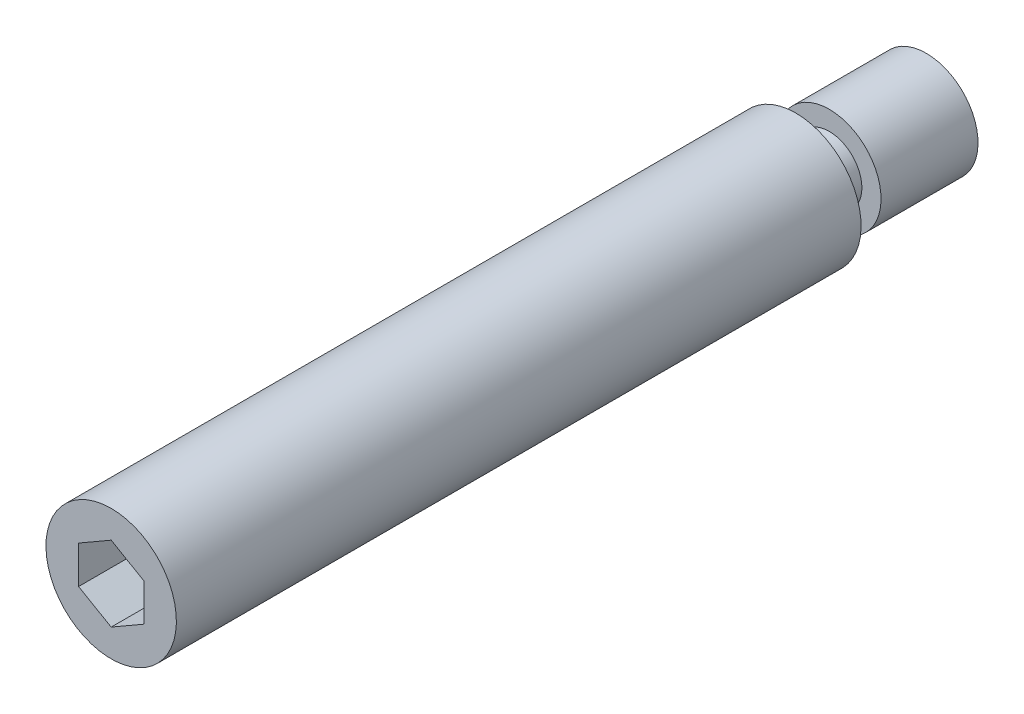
ISO-10303-21;
HEADER;
FILE_DESCRIPTION(('STEP AP214'),'2;1');
FILE_NAME('part.step','',(''),(''),'','','');
FILE_SCHEMA(('AUTOMOTIVE_DESIGN { 1 0 10303 214 1 1 1 1 }'));
ENDSEC;
DATA;
#1=APPLICATION_CONTEXT('core data for automotive mechanical design processes');
#2=APPLICATION_PROTOCOL_DEFINITION('international standard','automotive_design',2000,#1);
#3=PRODUCT_CONTEXT('',#1,'mechanical');
#4=PRODUCT('Part','Part','',(#3));
#5=PRODUCT_RELATED_PRODUCT_CATEGORY('part','',(#4));
#6=PRODUCT_DEFINITION_FORMATION('','',#4);
#7=PRODUCT_DEFINITION_CONTEXT('part definition',#1,'design');
#8=PRODUCT_DEFINITION('design','',#6,#7);
#9=PRODUCT_DEFINITION_SHAPE('','',#8);
#10=(LENGTH_UNIT() NAMED_UNIT(*) SI_UNIT(.MILLI.,.METRE.));
#11=(NAMED_UNIT(*) PLANE_ANGLE_UNIT() SI_UNIT($,.RADIAN.));
#12=(NAMED_UNIT(*) SI_UNIT($,.STERADIAN.) SOLID_ANGLE_UNIT());
#13=UNCERTAINTY_MEASURE_WITH_UNIT(LENGTH_MEASURE(1.E-05),#10,'distance_accuracy_value','');
#14=(GEOMETRIC_REPRESENTATION_CONTEXT(3) GLOBAL_UNCERTAINTY_ASSIGNED_CONTEXT((#13)) GLOBAL_UNIT_ASSIGNED_CONTEXT((#10,
#11,#12)) REPRESENTATION_CONTEXT('',''));
#15=CARTESIAN_POINT('',(0.,0.,0.));
#16=DIRECTION('',(0.,0.,1.));
#17=DIRECTION('',(1.,0.,0.));
#18=AXIS2_PLACEMENT_3D('',#15,#16,#17);
#19=CARTESIAN_POINT('',(0.,-8.,16.));
#20=DIRECTION('',(0.,0.,-1.));
#21=DIRECTION('',(0.,-1.,0.));
#22=AXIS2_PLACEMENT_3D('',#19,#20,#21);
#23=PLANE('',#22);
#24=CARTESIAN_POINT('',(0.,0.,16.));
#25=DIRECTION('',(0.,0.,1.));
#26=DIRECTION('',(0.,1.,0.));
#27=AXIS2_PLACEMENT_3D('',#24,#25,#26);
#28=CIRCLE('',#27,4.);
#29=CARTESIAN_POINT('',(0.,4.,16.));
#30=VERTEX_POINT('',#29);
#31=EDGE_CURVE('E115',#30,#30,#28,.T.);
#32=ORIENTED_EDGE('',*,*,#31,.T.);
#33=EDGE_LOOP('',(#32));
#34=FACE_BOUND('',#33,.T.);
#35=CARTESIAN_POINT('',(0.,0.,16.));
#36=DIRECTION('',(0.,0.,1.));
#37=DIRECTION('',(0.,1.,0.));
#38=AXIS2_PLACEMENT_3D('',#35,#36,#37);
#39=CIRCLE('',#38,8.);
#40=CARTESIAN_POINT('',(0.,8.,16.));
#41=VERTEX_POINT('',#40);
#42=EDGE_CURVE('E9',#41,#41,#39,.T.);
#43=ORIENTED_EDGE('',*,*,#42,.F.);
#44=EDGE_LOOP('',(#43));
#45=FACE_BOUND('',#44,.T.);
#46=ADVANCED_FACE('F14',(#34,#45),#23,.T.);
#47=CARTESIAN_POINT('',(0.,0.,20.));
#48=DIRECTION('',(0.,0.,1.));
#49=DIRECTION('',(0.,1.,0.));
#50=AXIS2_PLACEMENT_3D('',#47,#48,#49);
#51=CYLINDRICAL_SURFACE('',#50,8.);
#52=CARTESIAN_POINT('',(0.,0.,100.));
#53=DIRECTION('',(0.,0.,1.));
#54=DIRECTION('',(0.,1.,0.));
#55=AXIS2_PLACEMENT_3D('',#52,#53,#54);
#56=CIRCLE('',#55,8.);
#57=CARTESIAN_POINT('',(0.,8.,100.));
#58=VERTEX_POINT('',#57);
#59=EDGE_CURVE('E21',#58,#58,#56,.T.);
#60=ORIENTED_EDGE('',*,*,#59,.F.);
#61=EDGE_LOOP('',(#60));
#62=FACE_BOUND('',#61,.T.);
#63=ORIENTED_EDGE('',*,*,#42,.T.);
#64=EDGE_LOOP('',(#63));
#65=FACE_BOUND('',#64,.T.);
#66=ADVANCED_FACE('F136',(#62,#65),#51,.T.);
#67=CARTESIAN_POINT('',(0.,-8.,100.));
#68=DIRECTION('',(0.,0.,-1.));
#69=DIRECTION('',(0.,-1.,0.));
#70=AXIS2_PLACEMENT_3D('',#67,#68,#69);
#71=PLANE('',#70);
#72=DIRECTION('',(-0.866025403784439,-0.5,0.));
#73=VECTOR('',#72,1.);
#74=CARTESIAN_POINT('',(0.,4.61880215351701,100.));
#75=LINE('',#74,#73);
#76=CARTESIAN_POINT('',(0.,4.61880215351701,100.));
#77=VERTEX_POINT('',#76);
#78=CARTESIAN_POINT('',(-4.,2.30940107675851,100.));
#79=VERTEX_POINT('',#78);
#80=EDGE_CURVE('E102',#77,#79,#75,.T.);
#81=ORIENTED_EDGE('',*,*,#80,.F.);
#82=DIRECTION('',(-0.866025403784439,0.5,0.));
#83=VECTOR('',#82,1.);
#84=CARTESIAN_POINT('',(4.,2.30940107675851,100.));
#85=LINE('',#84,#83);
#86=CARTESIAN_POINT('',(4.,2.30940107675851,100.));
#87=VERTEX_POINT('',#86);
#88=EDGE_CURVE('E28',#87,#77,#85,.T.);
#89=ORIENTED_EDGE('',*,*,#88,.F.);
#90=DIRECTION('',(0.,1.,0.));
#91=VECTOR('',#90,1.);
#92=CARTESIAN_POINT('',(4.,-2.30940107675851,100.));
#93=LINE('',#92,#91);
#94=CARTESIAN_POINT('',(4.,-2.30940107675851,100.));
#95=VERTEX_POINT('',#94);
#96=EDGE_CURVE('E111',#95,#87,#93,.T.);
#97=ORIENTED_EDGE('',*,*,#96,.F.);
#98=DIRECTION('',(0.866025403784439,0.5,0.));
#99=VECTOR('',#98,1.);
#100=CARTESIAN_POINT('',(0.,-4.61880215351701,100.));
#101=LINE('',#100,#99);
#102=CARTESIAN_POINT('',(0.,-4.61880215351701,100.));
#103=VERTEX_POINT('',#102);
#104=EDGE_CURVE('E109',#103,#95,#101,.T.);
#105=ORIENTED_EDGE('',*,*,#104,.F.);
#106=DIRECTION('',(0.866025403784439,-0.5,0.));
#107=VECTOR('',#106,1.);
#108=CARTESIAN_POINT('',(-4.,-2.30940107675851,100.));
#109=LINE('',#108,#107);
#110=CARTESIAN_POINT('',(-4.,-2.30940107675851,100.));
#111=VERTEX_POINT('',#110);
#112=EDGE_CURVE('E76',#111,#103,#109,.T.);
#113=ORIENTED_EDGE('',*,*,#112,.F.);
#114=DIRECTION('',(0.,-1.,0.));
#115=VECTOR('',#114,1.);
#116=CARTESIAN_POINT('',(-4.,2.30940107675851,100.));
#117=LINE('',#116,#115);
#118=EDGE_CURVE('E105',#79,#111,#117,.T.);
#119=ORIENTED_EDGE('',*,*,#118,.F.);
#120=EDGE_LOOP('',(#81,#89,#97,#105,#113,#119));
#121=FACE_BOUND('',#120,.T.);
#122=ORIENTED_EDGE('',*,*,#59,.T.);
#123=EDGE_LOOP('',(#122));
#124=FACE_BOUND('',#123,.T.);
#125=ADVANCED_FACE('F134',(#121,#124),#71,.F.);
#126=CARTESIAN_POINT('',(0.,-6.35,0.));
#127=DIRECTION('',(0.,0.,-1.));
#128=DIRECTION('',(0.,-1.,0.));
#129=AXIS2_PLACEMENT_3D('',#126,#127,#128);
#130=PLANE('',#129);
#131=CARTESIAN_POINT('',(0.,0.,0.));
#132=DIRECTION('',(0.,0.,1.));
#133=DIRECTION('',(0.,1.,0.));
#134=AXIS2_PLACEMENT_3D('',#131,#132,#133);
#135=CIRCLE('',#134,6.35);
#136=CARTESIAN_POINT('',(0.,6.35,0.));
#137=VERTEX_POINT('',#136);
#138=EDGE_CURVE('E129',#137,#137,#135,.T.);
#139=ORIENTED_EDGE('',*,*,#138,.F.);
#140=EDGE_LOOP('',(#139));
#141=FACE_BOUND('',#140,.T.);
#142=ADVANCED_FACE('F167',(#141),#130,.T.);
#143=CARTESIAN_POINT('',(0.,0.,20.));
#144=DIRECTION('',(0.,0.,1.));
#145=DIRECTION('',(0.,1.,0.));
#146=AXIS2_PLACEMENT_3D('',#143,#144,#145);
#147=CYLINDRICAL_SURFACE('',#146,6.35);
#148=ORIENTED_EDGE('',*,*,#138,.T.);
#149=EDGE_LOOP('',(#148));
#150=FACE_BOUND('',#149,.T.);
#151=CARTESIAN_POINT('',(0.,0.,11.9));
#152=DIRECTION('',(0.,0.,1.));
#153=DIRECTION('',(0.,1.,0.));
#154=AXIS2_PLACEMENT_3D('',#151,#152,#153);
#155=CIRCLE('',#154,6.35);
#156=CARTESIAN_POINT('',(0.,6.35,11.9));
#157=VERTEX_POINT('',#156);
#158=EDGE_CURVE('E126',#157,#157,#155,.T.);
#159=ORIENTED_EDGE('',*,*,#158,.F.);
#160=EDGE_LOOP('',(#159));
#161=FACE_BOUND('',#160,.T.);
#162=ADVANCED_FACE('F160',(#150,#161),#147,.T.);
#163=CARTESIAN_POINT('',(0.,-4.,11.9));
#164=DIRECTION('',(0.,0.,1.));
#165=DIRECTION('',(0.,1.,0.));
#166=AXIS2_PLACEMENT_3D('',#163,#164,#165);
#167=PLANE('',#166);
#168=ORIENTED_EDGE('',*,*,#158,.T.);
#169=EDGE_LOOP('',(#168));
#170=FACE_BOUND('',#169,.T.);
#171=CARTESIAN_POINT('',(0.,0.,11.9));
#172=DIRECTION('',(0.,0.,1.));
#173=DIRECTION('',(0.,1.,0.));
#174=AXIS2_PLACEMENT_3D('',#171,#172,#173);
#175=CIRCLE('',#174,4.);
#176=CARTESIAN_POINT('',(0.,4.,11.9));
#177=VERTEX_POINT('',#176);
#178=EDGE_CURVE('E123',#177,#177,#175,.T.);
#179=ORIENTED_EDGE('',*,*,#178,.F.);
#180=EDGE_LOOP('',(#179));
#181=FACE_BOUND('',#180,.T.);
#182=ADVANCED_FACE('F151',(#170,#181),#167,.T.);
#183=CARTESIAN_POINT('',(0.,0.,20.));
#184=DIRECTION('',(0.,0.,1.));
#185=DIRECTION('',(0.,1.,0.));
#186=AXIS2_PLACEMENT_3D('',#183,#184,#185);
#187=CYLINDRICAL_SURFACE('',#186,4.);
#188=ORIENTED_EDGE('',*,*,#178,.T.);
#189=EDGE_LOOP('',(#188));
#190=FACE_BOUND('',#189,.T.);
#191=ORIENTED_EDGE('',*,*,#31,.F.);
#192=EDGE_LOOP('',(#191));
#193=FACE_BOUND('',#192,.T.);
#194=ADVANCED_FACE('F148',(#190,#193),#187,.T.);
#195=CARTESIAN_POINT('',(4.,2.30940107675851,90.));
#196=DIRECTION('',(0.5,0.866025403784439,0.));
#197=DIRECTION('',(-0.866025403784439,0.5,0.));
#198=AXIS2_PLACEMENT_3D('',#195,#196,#197);
#199=PLANE('',#198);
#200=ORIENTED_EDGE('',*,*,#88,.T.);
#201=DIRECTION('',(0.,0.,1.));
#202=VECTOR('',#201,1.);
#203=CARTESIAN_POINT('',(0.,4.61880215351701,90.));
#204=LINE('',#203,#202);
#205=CARTESIAN_POINT('',(0.,4.61880215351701,90.));
#206=VERTEX_POINT('',#205);
#207=EDGE_CURVE('E58',#206,#77,#204,.T.);
#208=ORIENTED_EDGE('',*,*,#207,.F.);
#209=DIRECTION('',(-0.866025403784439,0.5,0.));
#210=VECTOR('',#209,1.);
#211=CARTESIAN_POINT('',(4.,2.30940107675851,90.));
#212=LINE('',#211,#210);
#213=CARTESIAN_POINT('',(4.,2.30940107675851,90.));
#214=VERTEX_POINT('',#213);
#215=EDGE_CURVE('E113',#214,#206,#212,.T.);
#216=ORIENTED_EDGE('',*,*,#215,.F.);
#217=DIRECTION('',(0.,0.,1.));
#218=VECTOR('',#217,1.);
#219=CARTESIAN_POINT('',(4.,2.30940107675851,90.));
#220=LINE('',#219,#218);
#221=EDGE_CURVE('E36',#214,#87,#220,.T.);
#222=ORIENTED_EDGE('',*,*,#221,.T.);
#223=EDGE_LOOP('',(#200,#208,#216,#222));
#224=FACE_BOUND('',#223,.T.);
#225=ADVANCED_FACE('F150',(#224),#199,.F.);
#226=CARTESIAN_POINT('',(4.,-2.30940107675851,90.));
#227=DIRECTION('',(1.,0.,0.));
#228=DIRECTION('',(0.,0.,-1.));
#229=AXIS2_PLACEMENT_3D('',#226,#227,#228);
#230=PLANE('',#229);
#231=ORIENTED_EDGE('',*,*,#96,.T.);
#232=ORIENTED_EDGE('',*,*,#221,.F.);
#233=DIRECTION('',(0.,1.,0.));
#234=VECTOR('',#233,1.);
#235=CARTESIAN_POINT('',(4.,-2.30940107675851,90.));
#236=LINE('',#235,#234);
#237=CARTESIAN_POINT('',(4.,-2.30940107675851,90.));
#238=VERTEX_POINT('',#237);
#239=EDGE_CURVE('E88',#238,#214,#236,.T.);
#240=ORIENTED_EDGE('',*,*,#239,.F.);
#241=DIRECTION('',(0.,0.,1.));
#242=VECTOR('',#241,1.);
#243=CARTESIAN_POINT('',(4.,-2.30940107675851,90.));
#244=LINE('',#243,#242);
#245=EDGE_CURVE('E80',#238,#95,#244,.T.);
#246=ORIENTED_EDGE('',*,*,#245,.T.);
#247=EDGE_LOOP('',(#231,#232,#240,#246));
#248=FACE_BOUND('',#247,.T.);
#249=ADVANCED_FACE('F158',(#248),#230,.F.);
#250=CARTESIAN_POINT('',(0.,-4.61880215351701,90.));
#251=DIRECTION('',(0.5,-0.866025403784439,0.));
#252=DIRECTION('',(0.866025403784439,0.5,0.));
#253=AXIS2_PLACEMENT_3D('',#250,#251,#252);
#254=PLANE('',#253);
#255=ORIENTED_EDGE('',*,*,#104,.T.);
#256=ORIENTED_EDGE('',*,*,#245,.F.);
#257=DIRECTION('',(0.866025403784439,0.5,0.));
#258=VECTOR('',#257,1.);
#259=CARTESIAN_POINT('',(0.,-4.61880215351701,90.));
#260=LINE('',#259,#258);
#261=CARTESIAN_POINT('',(0.,-4.61880215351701,90.));
#262=VERTEX_POINT('',#261);
#263=EDGE_CURVE('E84',#262,#238,#260,.T.);
#264=ORIENTED_EDGE('',*,*,#263,.F.);
#265=DIRECTION('',(0.,0.,1.));
#266=VECTOR('',#265,1.);
#267=CARTESIAN_POINT('',(0.,-4.61880215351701,90.));
#268=LINE('',#267,#266);
#269=EDGE_CURVE('E69',#262,#103,#268,.T.);
#270=ORIENTED_EDGE('',*,*,#269,.T.);
#271=EDGE_LOOP('',(#255,#256,#264,#270));
#272=FACE_BOUND('',#271,.T.);
#273=ADVANCED_FACE('F85',(#272),#254,.F.);
#274=CARTESIAN_POINT('',(-4.,-2.30940107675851,90.));
#275=DIRECTION('',(-0.5,-0.866025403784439,0.));
#276=DIRECTION('',(0.866025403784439,-0.5,0.));
#277=AXIS2_PLACEMENT_3D('',#274,#275,#276);
#278=PLANE('',#277);
#279=ORIENTED_EDGE('',*,*,#112,.T.);
#280=ORIENTED_EDGE('',*,*,#269,.F.);
#281=DIRECTION('',(0.866025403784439,-0.5,0.));
#282=VECTOR('',#281,1.);
#283=CARTESIAN_POINT('',(-4.,-2.30940107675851,90.));
#284=LINE('',#283,#282);
#285=CARTESIAN_POINT('',(-4.,-2.30940107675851,90.));
#286=VERTEX_POINT('',#285);
#287=EDGE_CURVE('E73',#286,#262,#284,.T.);
#288=ORIENTED_EDGE('',*,*,#287,.F.);
#289=DIRECTION('',(0.,0.,1.));
#290=VECTOR('',#289,1.);
#291=CARTESIAN_POINT('',(-4.,-2.30940107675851,90.));
#292=LINE('',#291,#290);
#293=EDGE_CURVE('E81',#286,#111,#292,.T.);
#294=ORIENTED_EDGE('',*,*,#293,.T.);
#295=EDGE_LOOP('',(#279,#280,#288,#294));
#296=FACE_BOUND('',#295,.T.);
#297=ADVANCED_FACE('F71',(#296),#278,.F.);
#298=CARTESIAN_POINT('',(-4.,2.30940107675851,90.));
#299=DIRECTION('',(-1.,0.,0.));
#300=DIRECTION('',(0.,-1.,0.));
#301=AXIS2_PLACEMENT_3D('',#298,#299,#300);
#302=PLANE('',#301);
#303=ORIENTED_EDGE('',*,*,#118,.T.);
#304=ORIENTED_EDGE('',*,*,#293,.F.);
#305=DIRECTION('',(0.,-1.,0.));
#306=VECTOR('',#305,1.);
#307=CARTESIAN_POINT('',(-4.,2.30940107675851,90.));
#308=LINE('',#307,#306);
#309=CARTESIAN_POINT('',(-4.,2.30940107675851,90.));
#310=VERTEX_POINT('',#309);
#311=EDGE_CURVE('E94',#310,#286,#308,.T.);
#312=ORIENTED_EDGE('',*,*,#311,.F.);
#313=DIRECTION('',(0.,0.,1.));
#314=VECTOR('',#313,1.);
#315=CARTESIAN_POINT('',(-4.,2.30940107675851,90.));
#316=LINE('',#315,#314);
#317=EDGE_CURVE('E118',#310,#79,#316,.T.);
#318=ORIENTED_EDGE('',*,*,#317,.T.);
#319=EDGE_LOOP('',(#303,#304,#312,#318));
#320=FACE_BOUND('',#319,.T.);
#321=ADVANCED_FACE('F192',(#320),#302,.F.);
#322=CARTESIAN_POINT('',(0.,4.61880215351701,90.));
#323=DIRECTION('',(-0.5,0.866025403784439,0.));
#324=DIRECTION('',(-0.866025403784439,-0.5,0.));
#325=AXIS2_PLACEMENT_3D('',#322,#323,#324);
#326=PLANE('',#325);
#327=ORIENTED_EDGE('',*,*,#80,.T.);
#328=ORIENTED_EDGE('',*,*,#317,.F.);
#329=DIRECTION('',(-0.866025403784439,-0.5,0.));
#330=VECTOR('',#329,1.);
#331=CARTESIAN_POINT('',(0.,4.61880215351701,90.));
#332=LINE('',#331,#330);
#333=EDGE_CURVE('E96',#206,#310,#332,.T.);
#334=ORIENTED_EDGE('',*,*,#333,.F.);
#335=ORIENTED_EDGE('',*,*,#207,.T.);
#336=EDGE_LOOP('',(#327,#328,#334,#335));
#337=FACE_BOUND('',#336,.T.);
#338=ADVANCED_FACE('F180',(#337),#326,.F.);
#339=CARTESIAN_POINT('',(0.,4.61880215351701,90.));
#340=DIRECTION('',(0.,0.,1.));
#341=DIRECTION('',(1.,0.,0.));
#342=AXIS2_PLACEMENT_3D('',#339,#340,#341);
#343=PLANE('',#342);
#344=ORIENTED_EDGE('',*,*,#215,.T.);
#345=ORIENTED_EDGE('',*,*,#333,.T.);
#346=ORIENTED_EDGE('',*,*,#311,.T.);
#347=ORIENTED_EDGE('',*,*,#287,.T.);
#348=ORIENTED_EDGE('',*,*,#263,.T.);
#349=ORIENTED_EDGE('',*,*,#239,.T.);
#350=EDGE_LOOP('',(#344,#345,#346,#347,#348,#349));
#351=FACE_BOUND('',#350,.T.);
#352=ADVANCED_FACE('F91',(#351),#343,.T.);
#353=CLOSED_SHELL('',(#46,#66,#125,#142,#162,#182,#194,#225,#249,#273,#297,#321,#338,#352));
#354=MANIFOLD_SOLID_BREP('B1',#353);
#355=ADVANCED_BREP_SHAPE_REPRESENTATION('',(#18,#354),#14);
#356=SHAPE_DEFINITION_REPRESENTATION(#9,#355);
ENDSEC;
END-ISO-10303-21;
